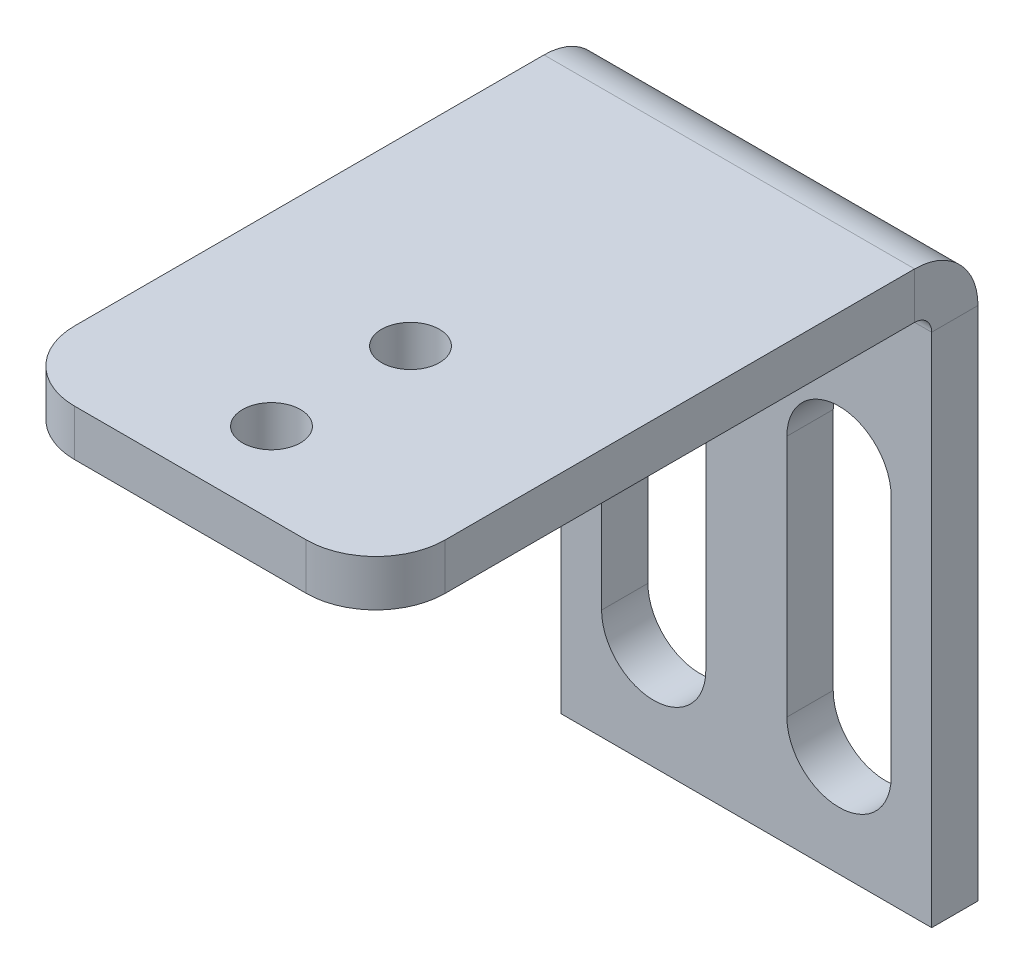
ISO-10303-21;
HEADER;
FILE_DESCRIPTION(('STEP AP214'),'2;1');
FILE_NAME('part.step','',(''),(''),'','','');
FILE_SCHEMA(('AUTOMOTIVE_DESIGN { 1 0 10303 214 1 1 1 1 }'));
ENDSEC;
DATA;
#1=APPLICATION_CONTEXT('core data for automotive mechanical design processes');
#2=APPLICATION_PROTOCOL_DEFINITION('international standard','automotive_design',2000,#1);
#3=PRODUCT_CONTEXT('',#1,'mechanical');
#4=PRODUCT('Part','Part','',(#3));
#5=PRODUCT_RELATED_PRODUCT_CATEGORY('part','',(#4));
#6=PRODUCT_DEFINITION_FORMATION('','',#4);
#7=PRODUCT_DEFINITION_CONTEXT('part definition',#1,'design');
#8=PRODUCT_DEFINITION('design','',#6,#7);
#9=PRODUCT_DEFINITION_SHAPE('','',#8);
#10=(LENGTH_UNIT() NAMED_UNIT(*) SI_UNIT(.MILLI.,.METRE.));
#11=(NAMED_UNIT(*) PLANE_ANGLE_UNIT() SI_UNIT($,.RADIAN.));
#12=(NAMED_UNIT(*) SI_UNIT($,.STERADIAN.) SOLID_ANGLE_UNIT());
#13=UNCERTAINTY_MEASURE_WITH_UNIT(LENGTH_MEASURE(1.E-05),#10,'distance_accuracy_value','');
#14=(GEOMETRIC_REPRESENTATION_CONTEXT(3) GLOBAL_UNCERTAINTY_ASSIGNED_CONTEXT((#13)) GLOBAL_UNIT_ASSIGNED_CONTEXT((#10,
#11,#12)) REPRESENTATION_CONTEXT('',''));
#15=CARTESIAN_POINT('',(0.,0.,0.));
#16=DIRECTION('',(0.,0.,1.));
#17=DIRECTION('',(1.,0.,0.));
#18=AXIS2_PLACEMENT_3D('',#15,#16,#17);
#19=CARTESIAN_POINT('',(0.,0.,-2.));
#20=DIRECTION('',(0.,0.,1.));
#21=DIRECTION('',(1.,0.,0.));
#22=AXIS2_PLACEMENT_3D('',#19,#20,#21);
#23=PLANE('',#22);
#24=DIRECTION('',(0.,-1.,0.));
#25=VECTOR('',#24,1.);
#26=CARTESIAN_POINT('',(0.051480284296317,0.25,-2.));
#27=LINE('',#26,#25);
#28=CARTESIAN_POINT('',(0.051480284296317,0.25,-2.));
#29=VERTEX_POINT('',#28);
#30=CARTESIAN_POINT('',(0.051480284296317,-10.25,-2.));
#31=VERTEX_POINT('',#30);
#32=EDGE_CURVE('E187',#29,#31,#27,.T.);
#33=ORIENTED_EDGE('',*,*,#32,.F.);
#34=CARTESIAN_POINT('',(-2.19851971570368,0.25,-2.));
#35=DIRECTION('',(0.,0.,1.));
#36=DIRECTION('',(1.,0.,0.));
#37=AXIS2_PLACEMENT_3D('',#34,#35,#36);
#38=CIRCLE('',#37,2.25);
#39=CARTESIAN_POINT('',(-4.44851971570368,0.25,-2.));
#40=VERTEX_POINT('',#39);
#41=EDGE_CURVE('E198',#29,#40,#38,.T.);
#42=ORIENTED_EDGE('',*,*,#41,.T.);
#43=DIRECTION('',(0.,-1.,0.));
#44=VECTOR('',#43,1.);
#45=CARTESIAN_POINT('',(-4.44851971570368,0.25,-2.));
#46=LINE('',#45,#44);
#47=CARTESIAN_POINT('',(-4.44851971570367,-10.25,-2.));
#48=VERTEX_POINT('',#47);
#49=EDGE_CURVE('E184',#40,#48,#46,.T.);
#50=ORIENTED_EDGE('',*,*,#49,.T.);
#51=CARTESIAN_POINT('',(-2.19851971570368,-10.25,-2.));
#52=DIRECTION('',(0.,0.,1.));
#53=DIRECTION('',(1.,0.,0.));
#54=AXIS2_PLACEMENT_3D('',#51,#52,#53);
#55=CIRCLE('',#54,2.25);
#56=EDGE_CURVE('E208',#48,#31,#55,.T.);
#57=ORIENTED_EDGE('',*,*,#56,.T.);
#58=EDGE_LOOP('',(#33,#42,#50,#57));
#59=FACE_BOUND('',#58,.T.);
#60=DIRECTION('',(-1.,0.,0.));
#61=VECTOR('',#60,1.);
#62=CARTESIAN_POINT('',(-6.19851971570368,7.2634,-2.));
#63=LINE('',#62,#61);
#64=CARTESIAN_POINT('',(-6.19851971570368,7.2634,-2.));
#65=VERTEX_POINT('',#64);
#66=CARTESIAN_POINT('',(9.80148028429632,7.2634,-2.));
#67=VERTEX_POINT('',#66);
#68=EDGE_CURVE('E238',#65,#67,#63,.F.);
#69=ORIENTED_EDGE('',*,*,#68,.T.);
#70=DIRECTION('',(0.,1.,0.));
#71=VECTOR('',#70,1.);
#72=CARTESIAN_POINT('',(9.80148028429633,-15.,-2.));
#73=LINE('',#72,#71);
#74=CARTESIAN_POINT('',(9.80148028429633,-15.,-2.));
#75=VERTEX_POINT('',#74);
#76=EDGE_CURVE('E261',#75,#67,#73,.T.);
#77=ORIENTED_EDGE('',*,*,#76,.F.);
#78=DIRECTION('',(1.,0.,0.));
#79=VECTOR('',#78,1.);
#80=CARTESIAN_POINT('',(9.80148028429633,-15.,-2.));
#81=LINE('',#80,#79);
#82=CARTESIAN_POINT('',(-6.19851971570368,-15.,-2.));
#83=VERTEX_POINT('',#82);
#84=EDGE_CURVE('E267',#83,#75,#81,.T.);
#85=ORIENTED_EDGE('',*,*,#84,.F.);
#86=DIRECTION('',(0.,-1.,0.));
#87=VECTOR('',#86,1.);
#88=CARTESIAN_POINT('',(-6.19851971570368,-15.,-2.));
#89=LINE('',#88,#87);
#90=EDGE_CURVE('E264',#65,#83,#89,.T.);
#91=ORIENTED_EDGE('',*,*,#90,.F.);
#92=EDGE_LOOP('',(#69,#77,#85,#91));
#93=FACE_BOUND('',#92,.T.);
#94=DIRECTION('',(0.,-1.,0.));
#95=VECTOR('',#94,1.);
#96=CARTESIAN_POINT('',(8.05148028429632,0.25,-2.));
#97=LINE('',#96,#95);
#98=CARTESIAN_POINT('',(8.05148028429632,0.25,-2.));
#99=VERTEX_POINT('',#98);
#100=CARTESIAN_POINT('',(8.05148028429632,-10.25,-2.));
#101=VERTEX_POINT('',#100);
#102=EDGE_CURVE('E154',#99,#101,#97,.T.);
#103=ORIENTED_EDGE('',*,*,#102,.F.);
#104=CARTESIAN_POINT('',(5.80148028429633,0.25,-2.));
#105=DIRECTION('',(0.,0.,1.));
#106=DIRECTION('',(1.,0.,0.));
#107=AXIS2_PLACEMENT_3D('',#104,#105,#106);
#108=CIRCLE('',#107,2.25);
#109=CARTESIAN_POINT('',(3.55148028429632,0.25,-2.));
#110=VERTEX_POINT('',#109);
#111=EDGE_CURVE('E162',#99,#110,#108,.T.);
#112=ORIENTED_EDGE('',*,*,#111,.T.);
#113=DIRECTION('',(0.,-1.,0.));
#114=VECTOR('',#113,1.);
#115=CARTESIAN_POINT('',(3.55148028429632,0.25,-2.));
#116=LINE('',#115,#114);
#117=CARTESIAN_POINT('',(3.55148028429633,-10.25,-2.));
#118=VERTEX_POINT('',#117);
#119=EDGE_CURVE('E637',#110,#118,#116,.T.);
#120=ORIENTED_EDGE('',*,*,#119,.T.);
#121=CARTESIAN_POINT('',(5.80148028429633,-10.25,-2.));
#122=DIRECTION('',(0.,0.,1.));
#123=DIRECTION('',(1.,0.,0.));
#124=AXIS2_PLACEMENT_3D('',#121,#122,#123);
#125=CIRCLE('',#124,2.25);
#126=EDGE_CURVE('E176',#118,#101,#125,.T.);
#127=ORIENTED_EDGE('',*,*,#126,.T.);
#128=EDGE_LOOP('',(#103,#112,#120,#127));
#129=FACE_BOUND('',#128,.T.);
#130=ADVANCED_FACE('F16',(#59,#93,#129),#23,.F.);
#131=CARTESIAN_POINT('',(0.,0.,0.));
#132=DIRECTION('',(0.,0.,1.));
#133=DIRECTION('',(1.,0.,0.));
#134=AXIS2_PLACEMENT_3D('',#131,#132,#133);
#135=PLANE('',#134);
#136=CARTESIAN_POINT('',(5.80148028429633,-10.25,0.));
#137=DIRECTION('',(0.,0.,1.));
#138=DIRECTION('',(1.,0.,0.));
#139=AXIS2_PLACEMENT_3D('',#136,#137,#138);
#140=CIRCLE('',#139,2.25);
#141=CARTESIAN_POINT('',(3.55148028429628,-10.25,0.));
#142=VERTEX_POINT('',#141);
#143=CARTESIAN_POINT('',(8.05148028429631,-10.25,0.));
#144=VERTEX_POINT('',#143);
#145=EDGE_CURVE('E174',#142,#144,#140,.T.);
#146=ORIENTED_EDGE('',*,*,#145,.F.);
#147=DIRECTION('',(0.,-1.,0.));
#148=VECTOR('',#147,1.);
#149=CARTESIAN_POINT('',(3.55148028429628,0.25,0.));
#150=LINE('',#149,#148);
#151=CARTESIAN_POINT('',(3.55148028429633,0.25,0.));
#152=VERTEX_POINT('',#151);
#153=EDGE_CURVE('E167',#152,#142,#150,.T.);
#154=ORIENTED_EDGE('',*,*,#153,.F.);
#155=CARTESIAN_POINT('',(5.80148028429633,0.25,0.));
#156=DIRECTION('',(0.,0.,1.));
#157=DIRECTION('',(1.,0.,0.));
#158=AXIS2_PLACEMENT_3D('',#155,#156,#157);
#159=CIRCLE('',#158,2.25);
#160=CARTESIAN_POINT('',(8.05148028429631,0.25,0.));
#161=VERTEX_POINT('',#160);
#162=EDGE_CURVE('E159',#161,#152,#159,.T.);
#163=ORIENTED_EDGE('',*,*,#162,.F.);
#164=DIRECTION('',(0.,-1.,0.));
#165=VECTOR('',#164,1.);
#166=CARTESIAN_POINT('',(8.05148028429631,0.25,0.));
#167=LINE('',#166,#165);
#168=EDGE_CURVE('E144',#161,#144,#167,.T.);
#169=ORIENTED_EDGE('',*,*,#168,.T.);
#170=EDGE_LOOP('',(#146,#154,#163,#169));
#171=FACE_BOUND('',#170,.T.);
#172=DIRECTION('',(0.,1.,0.));
#173=VECTOR('',#172,1.);
#174=CARTESIAN_POINT('',(9.80148028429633,-15.,0.));
#175=LINE('',#174,#173);
#176=CARTESIAN_POINT('',(9.80148028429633,-15.,0.));
#177=VERTEX_POINT('',#176);
#178=CARTESIAN_POINT('',(9.80148028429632,7.2634,0.));
#179=VERTEX_POINT('',#178);
#180=EDGE_CURVE('E258',#177,#179,#175,.T.);
#181=ORIENTED_EDGE('',*,*,#180,.T.);
#182=DIRECTION('',(-1.,0.,0.));
#183=VECTOR('',#182,1.);
#184=CARTESIAN_POINT('',(-6.19851971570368,7.2634,0.));
#185=LINE('',#184,#183);
#186=CARTESIAN_POINT('',(-6.19851971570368,7.2634,0.));
#187=VERTEX_POINT('',#186);
#188=EDGE_CURVE('E250',#187,#179,#185,.F.);
#189=ORIENTED_EDGE('',*,*,#188,.F.);
#190=DIRECTION('',(0.,-1.,0.));
#191=VECTOR('',#190,1.);
#192=CARTESIAN_POINT('',(-6.19851971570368,-15.,0.));
#193=LINE('',#192,#191);
#194=CARTESIAN_POINT('',(-6.19851971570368,-15.,0.));
#195=VERTEX_POINT('',#194);
#196=EDGE_CURVE('E273',#187,#195,#193,.T.);
#197=ORIENTED_EDGE('',*,*,#196,.T.);
#198=DIRECTION('',(1.,0.,0.));
#199=VECTOR('',#198,1.);
#200=CARTESIAN_POINT('',(9.80148028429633,-15.,0.));
#201=LINE('',#200,#199);
#202=EDGE_CURVE('E265',#195,#177,#201,.T.);
#203=ORIENTED_EDGE('',*,*,#202,.T.);
#204=EDGE_LOOP('',(#181,#189,#197,#203));
#205=FACE_BOUND('',#204,.T.);
#206=CARTESIAN_POINT('',(-2.19851971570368,0.25,0.));
#207=DIRECTION('',(0.,0.,1.));
#208=DIRECTION('',(1.,0.,0.));
#209=AXIS2_PLACEMENT_3D('',#206,#207,#208);
#210=CIRCLE('',#209,2.25);
#211=CARTESIAN_POINT('',(0.0514802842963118,0.25,0.));
#212=VERTEX_POINT('',#211);
#213=CARTESIAN_POINT('',(-4.44851971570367,0.25,0.));
#214=VERTEX_POINT('',#213);
#215=EDGE_CURVE('E196',#212,#214,#210,.T.);
#216=ORIENTED_EDGE('',*,*,#215,.F.);
#217=DIRECTION('',(0.,-1.,0.));
#218=VECTOR('',#217,1.);
#219=CARTESIAN_POINT('',(0.0514802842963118,0.25,0.));
#220=LINE('',#219,#218);
#221=CARTESIAN_POINT('',(0.0514802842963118,-10.25,0.));
#222=VERTEX_POINT('',#221);
#223=EDGE_CURVE('E190',#212,#222,#220,.T.);
#224=ORIENTED_EDGE('',*,*,#223,.T.);
#225=CARTESIAN_POINT('',(-2.19851971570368,-10.25,0.));
#226=DIRECTION('',(0.,0.,1.));
#227=DIRECTION('',(1.,0.,0.));
#228=AXIS2_PLACEMENT_3D('',#225,#226,#227);
#229=CIRCLE('',#228,2.25);
#230=CARTESIAN_POINT('',(-4.44851971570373,-10.25,0.));
#231=VERTEX_POINT('',#230);
#232=EDGE_CURVE('E206',#231,#222,#229,.T.);
#233=ORIENTED_EDGE('',*,*,#232,.F.);
#234=DIRECTION('',(0.,-1.,0.));
#235=VECTOR('',#234,1.);
#236=CARTESIAN_POINT('',(-4.44851971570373,0.25,0.));
#237=LINE('',#236,#235);
#238=EDGE_CURVE('E182',#214,#231,#237,.T.);
#239=ORIENTED_EDGE('',*,*,#238,.F.);
#240=EDGE_LOOP('',(#216,#224,#233,#239));
#241=FACE_BOUND('',#240,.T.);
#242=ADVANCED_FACE('F165',(#171,#205,#241),#135,.T.);
#243=CARTESIAN_POINT('',(-6.19851971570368,-15.,-2.));
#244=DIRECTION('',(-1.,0.,0.));
#245=DIRECTION('',(0.,0.,1.));
#246=AXIS2_PLACEMENT_3D('',#243,#244,#245);
#247=PLANE('',#246);
#248=ORIENTED_EDGE('',*,*,#196,.F.);
#249=DIRECTION('',(0.,0.,-1.));
#250=VECTOR('',#249,1.);
#251=CARTESIAN_POINT('',(-6.19851971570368,7.2634,0.));
#252=LINE('',#251,#250);
#253=EDGE_CURVE('E244',#187,#65,#252,.T.);
#254=ORIENTED_EDGE('',*,*,#253,.T.);
#255=ORIENTED_EDGE('',*,*,#90,.T.);
#256=DIRECTION('',(0.,0.,1.));
#257=VECTOR('',#256,1.);
#258=CARTESIAN_POINT('',(-6.19851971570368,-15.,-2.));
#259=LINE('',#258,#257);
#260=EDGE_CURVE('E270',#83,#195,#259,.T.);
#261=ORIENTED_EDGE('',*,*,#260,.T.);
#262=EDGE_LOOP('',(#248,#254,#255,#261));
#263=FACE_BOUND('',#262,.T.);
#264=ADVANCED_FACE('F354',(#263),#247,.T.);
#265=CARTESIAN_POINT('',(9.80148028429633,-15.,-2.));
#266=DIRECTION('',(1.,0.,0.));
#267=DIRECTION('',(0.,1.,0.));
#268=AXIS2_PLACEMENT_3D('',#265,#266,#267);
#269=PLANE('',#268);
#270=DIRECTION('',(0.,0.,-1.));
#271=VECTOR('',#270,1.);
#272=CARTESIAN_POINT('',(9.80148028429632,7.2634,0.));
#273=LINE('',#272,#271);
#274=EDGE_CURVE('E255',#179,#67,#273,.T.);
#275=ORIENTED_EDGE('',*,*,#274,.F.);
#276=ORIENTED_EDGE('',*,*,#180,.F.);
#277=DIRECTION('',(0.,0.,1.));
#278=VECTOR('',#277,1.);
#279=CARTESIAN_POINT('',(9.80148028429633,-15.,-2.));
#280=LINE('',#279,#278);
#281=EDGE_CURVE('E277',#75,#177,#280,.T.);
#282=ORIENTED_EDGE('',*,*,#281,.F.);
#283=ORIENTED_EDGE('',*,*,#76,.T.);
#284=EDGE_LOOP('',(#275,#276,#282,#283));
#285=FACE_BOUND('',#284,.T.);
#286=ADVANCED_FACE('F329',(#285),#269,.T.);
#287=CARTESIAN_POINT('',(9.80148028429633,-15.,-2.));
#288=DIRECTION('',(0.,-1.,0.));
#289=DIRECTION('',(0.,0.,-1.));
#290=AXIS2_PLACEMENT_3D('',#287,#288,#289);
#291=PLANE('',#290);
#292=ORIENTED_EDGE('',*,*,#202,.F.);
#293=ORIENTED_EDGE('',*,*,#260,.F.);
#294=ORIENTED_EDGE('',*,*,#84,.T.);
#295=ORIENTED_EDGE('',*,*,#281,.T.);
#296=EDGE_LOOP('',(#292,#293,#294,#295));
#297=FACE_BOUND('',#296,.T.);
#298=ADVANCED_FACE('F360',(#297),#291,.T.);
#299=CARTESIAN_POINT('',(9.80148028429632,7.2634,0.7366));
#300=DIRECTION('',(1.,0.,0.));
#301=DIRECTION('',(0.,0.,-1.));
#302=AXIS2_PLACEMENT_3D('',#299,#300,#301);
#303=PLANE('',#302);
#304=DIRECTION('',(0.,-1.,0.));
#305=VECTOR('',#304,1.);
#306=CARTESIAN_POINT('',(9.80148028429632,10.,0.73659999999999));
#307=LINE('',#306,#305);
#308=CARTESIAN_POINT('',(9.80148028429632,8.,0.7366));
#309=VERTEX_POINT('',#308);
#310=CARTESIAN_POINT('',(9.80148028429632,10.,0.73659999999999));
#311=VERTEX_POINT('',#310);
#312=EDGE_CURVE('E214',#309,#311,#307,.F.);
#313=ORIENTED_EDGE('',*,*,#312,.F.);
#314=CARTESIAN_POINT('',(9.80148028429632,7.2634,0.7366));
#315=DIRECTION('',(-1.,0.,0.));
#316=DIRECTION('',(0.,0.,1.));
#317=AXIS2_PLACEMENT_3D('',#314,#315,#316);
#318=CIRCLE('',#317,0.7366);
#319=EDGE_CURVE('E247',#179,#309,#318,.F.);
#320=ORIENTED_EDGE('',*,*,#319,.F.);
#321=ORIENTED_EDGE('',*,*,#274,.T.);
#322=CARTESIAN_POINT('',(9.80148028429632,7.2634,0.7366));
#323=DIRECTION('',(-1.,0.,0.));
#324=DIRECTION('',(0.,0.,1.));
#325=AXIS2_PLACEMENT_3D('',#322,#323,#324);
#326=CIRCLE('',#325,2.7366);
#327=EDGE_CURVE('E240',#67,#311,#326,.F.);
#328=ORIENTED_EDGE('',*,*,#327,.T.);
#329=EDGE_LOOP('',(#313,#320,#321,#328));
#330=FACE_BOUND('',#329,.T.);
#331=ADVANCED_FACE('F325',(#330),#303,.T.);
#332=CARTESIAN_POINT('',(-6.19851971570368,7.2634,0.7366));
#333=DIRECTION('',(1.,0.,0.));
#334=DIRECTION('',(0.,0.,-1.));
#335=AXIS2_PLACEMENT_3D('',#332,#333,#334);
#336=PLANE('',#335);
#337=CARTESIAN_POINT('',(-6.19851971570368,7.2634,0.7366));
#338=DIRECTION('',(-1.,0.,0.));
#339=DIRECTION('',(0.,0.,1.));
#340=AXIS2_PLACEMENT_3D('',#337,#338,#339);
#341=CIRCLE('',#340,0.7366);
#342=CARTESIAN_POINT('',(-6.19851971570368,8.,0.7366));
#343=VERTEX_POINT('',#342);
#344=EDGE_CURVE('E217',#343,#187,#341,.T.);
#345=ORIENTED_EDGE('',*,*,#344,.F.);
#346=DIRECTION('',(0.,-1.,0.));
#347=VECTOR('',#346,1.);
#348=CARTESIAN_POINT('',(-6.19851971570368,8.,0.7366));
#349=LINE('',#348,#347);
#350=CARTESIAN_POINT('',(-6.19851971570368,10.,0.736599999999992));
#351=VERTEX_POINT('',#350);
#352=EDGE_CURVE('E231',#343,#351,#349,.F.);
#353=ORIENTED_EDGE('',*,*,#352,.T.);
#354=CARTESIAN_POINT('',(-6.19851971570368,7.2634,0.7366));
#355=DIRECTION('',(-1.,0.,0.));
#356=DIRECTION('',(0.,0.,1.));
#357=AXIS2_PLACEMENT_3D('',#354,#355,#356);
#358=CIRCLE('',#357,2.7366);
#359=EDGE_CURVE('E241',#351,#65,#358,.T.);
#360=ORIENTED_EDGE('',*,*,#359,.T.);
#361=ORIENTED_EDGE('',*,*,#253,.F.);
#362=EDGE_LOOP('',(#345,#353,#360,#361));
#363=FACE_BOUND('',#362,.T.);
#364=ADVANCED_FACE('F318',(#363),#336,.F.);
#365=CARTESIAN_POINT('',(-6.19851971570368,7.2634,0.7366));
#366=DIRECTION('',(-1.,0.,0.));
#367=DIRECTION('',(0.,1.,0.));
#368=AXIS2_PLACEMENT_3D('',#365,#366,#367);
#369=CYLINDRICAL_SURFACE('',#368,2.7366);
#370=ORIENTED_EDGE('',*,*,#68,.F.);
#371=ORIENTED_EDGE('',*,*,#359,.F.);
#372=DIRECTION('',(-1.,0.,0.));
#373=VECTOR('',#372,1.);
#374=CARTESIAN_POINT('',(9.80148028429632,10.,0.73659999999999));
#375=LINE('',#374,#373);
#376=EDGE_CURVE('E228',#351,#311,#375,.F.);
#377=ORIENTED_EDGE('',*,*,#376,.T.);
#378=ORIENTED_EDGE('',*,*,#327,.F.);
#379=EDGE_LOOP('',(#370,#371,#377,#378));
#380=FACE_BOUND('',#379,.T.);
#381=ADVANCED_FACE('F323',(#380),#369,.T.);
#382=CARTESIAN_POINT('',(-6.19851971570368,7.2634,0.7366));
#383=DIRECTION('',(-1.,0.,0.));
#384=DIRECTION('',(0.,1.,0.));
#385=AXIS2_PLACEMENT_3D('',#382,#383,#384);
#386=CYLINDRICAL_SURFACE('',#385,0.7366);
#387=ORIENTED_EDGE('',*,*,#188,.T.);
#388=ORIENTED_EDGE('',*,*,#319,.T.);
#389=DIRECTION('',(-1.,0.,0.));
#390=VECTOR('',#389,1.);
#391=CARTESIAN_POINT('',(9.80148028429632,8.,0.7366));
#392=LINE('',#391,#390);
#393=EDGE_CURVE('E234',#309,#343,#392,.T.);
#394=ORIENTED_EDGE('',*,*,#393,.T.);
#395=ORIENTED_EDGE('',*,*,#344,.T.);
#396=EDGE_LOOP('',(#387,#388,#394,#395));
#397=FACE_BOUND('',#396,.T.);
#398=ADVANCED_FACE('F335',(#397),#386,.F.);
#399=CARTESIAN_POINT('',(9.80148028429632,10.,0.));
#400=DIRECTION('',(-1.,0.,0.));
#401=DIRECTION('',(0.,-1.,0.));
#402=AXIS2_PLACEMENT_3D('',#399,#400,#401);
#403=PLANE('',#402);
#404=DIRECTION('',(0.,0.,-1.));
#405=VECTOR('',#404,1.);
#406=CARTESIAN_POINT('',(9.80148028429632,10.,0.));
#407=LINE('',#406,#405);
#408=CARTESIAN_POINT('',(9.80148028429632,10.,21.));
#409=VERTEX_POINT('',#408);
#410=EDGE_CURVE('E220',#409,#311,#407,.T.);
#411=ORIENTED_EDGE('',*,*,#410,.F.);
#412=DIRECTION('',(0.,-1.,0.));
#413=VECTOR('',#412,1.);
#414=CARTESIAN_POINT('',(9.80148028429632,10.,21.));
#415=LINE('',#414,#413);
#416=CARTESIAN_POINT('',(9.80148028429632,8.,21.));
#417=VERTEX_POINT('',#416);
#418=EDGE_CURVE('E279',#409,#417,#415,.T.);
#419=ORIENTED_EDGE('',*,*,#418,.T.);
#420=DIRECTION('',(0.,0.,1.));
#421=VECTOR('',#420,1.);
#422=CARTESIAN_POINT('',(9.80148028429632,8.,0.));
#423=LINE('',#422,#421);
#424=EDGE_CURVE('E226',#417,#309,#423,.F.);
#425=ORIENTED_EDGE('',*,*,#424,.T.);
#426=ORIENTED_EDGE('',*,*,#312,.T.);
#427=EDGE_LOOP('',(#411,#419,#425,#426));
#428=FACE_BOUND('',#427,.T.);
#429=ADVANCED_FACE('F301',(#428),#403,.F.);
#430=CARTESIAN_POINT('',(-6.19851971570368,10.,24.));
#431=DIRECTION('',(1.,0.,0.));
#432=DIRECTION('',(0.,1.,0.));
#433=AXIS2_PLACEMENT_3D('',#430,#431,#432);
#434=PLANE('',#433);
#435=DIRECTION('',(0.,0.,-1.));
#436=VECTOR('',#435,1.);
#437=CARTESIAN_POINT('',(-6.19851971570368,8.,24.));
#438=LINE('',#437,#436);
#439=CARTESIAN_POINT('',(-6.19851971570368,8.,21.));
#440=VERTEX_POINT('',#439);
#441=EDGE_CURVE('E224',#343,#440,#438,.F.);
#442=ORIENTED_EDGE('',*,*,#441,.T.);
#443=DIRECTION('',(0.,-1.,0.));
#444=VECTOR('',#443,1.);
#445=CARTESIAN_POINT('',(-6.19851971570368,10.,21.));
#446=LINE('',#445,#444);
#447=CARTESIAN_POINT('',(-6.19851971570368,10.,21.));
#448=VERTEX_POINT('',#447);
#449=EDGE_CURVE('E11',#440,#448,#446,.F.);
#450=ORIENTED_EDGE('',*,*,#449,.T.);
#451=DIRECTION('',(0.,0.,1.));
#452=VECTOR('',#451,1.);
#453=CARTESIAN_POINT('',(-6.19851971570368,10.,0.));
#454=LINE('',#453,#452);
#455=EDGE_CURVE('E218',#351,#448,#454,.T.);
#456=ORIENTED_EDGE('',*,*,#455,.F.);
#457=ORIENTED_EDGE('',*,*,#352,.F.);
#458=EDGE_LOOP('',(#442,#450,#456,#457));
#459=FACE_BOUND('',#458,.T.);
#460=ADVANCED_FACE('F315',(#459),#434,.F.);
#461=CARTESIAN_POINT('',(0.,10.,0.));
#462=DIRECTION('',(0.,-1.,0.));
#463=DIRECTION('',(0.,0.,-1.));
#464=AXIS2_PLACEMENT_3D('',#461,#462,#463);
#465=PLANE('',#464);
#466=CARTESIAN_POINT('',(1.80148028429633,10.0000000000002,20.5));
#467=DIRECTION('',(0.,-1.,0.));
#468=DIRECTION('',(0.,0.,-1.));
#469=AXIS2_PLACEMENT_3D('',#466,#467,#468);
#470=CIRCLE('',#469,1.25);
#471=CARTESIAN_POINT('',(1.80148028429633,10.0000000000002,19.25));
#472=VERTEX_POINT('',#471);
#473=EDGE_CURVE('E628',#472,#472,#470,.T.);
#474=ORIENTED_EDGE('',*,*,#473,.T.);
#475=EDGE_LOOP('',(#474));
#476=FACE_BOUND('',#475,.T.);
#477=CARTESIAN_POINT('',(1.80148028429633,10.0000000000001,14.5));
#478=DIRECTION('',(0.,-1.,0.));
#479=DIRECTION('',(0.,0.,-1.));
#480=AXIS2_PLACEMENT_3D('',#477,#478,#479);
#481=CIRCLE('',#480,1.25);
#482=CARTESIAN_POINT('',(1.80148028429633,10.0000000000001,13.25));
#483=VERTEX_POINT('',#482);
#484=EDGE_CURVE('E627',#483,#483,#481,.T.);
#485=ORIENTED_EDGE('',*,*,#484,.T.);
#486=EDGE_LOOP('',(#485));
#487=FACE_BOUND('',#486,.T.);
#488=DIRECTION('',(1.,0.,0.));
#489=VECTOR('',#488,1.);
#490=CARTESIAN_POINT('',(0.,10.,24.));
#491=LINE('',#490,#489);
#492=CARTESIAN_POINT('',(-3.19851971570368,10.,24.));
#493=VERTEX_POINT('',#492);
#494=CARTESIAN_POINT('',(6.80148028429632,10.,24.));
#495=VERTEX_POINT('',#494);
#496=EDGE_CURVE('E215',#493,#495,#491,.T.);
#497=ORIENTED_EDGE('',*,*,#496,.T.);
#498=CARTESIAN_POINT('',(6.80148028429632,10.,21.));
#499=DIRECTION('',(0.,-1.,0.));
#500=DIRECTION('',(0.,0.,-1.));
#501=AXIS2_PLACEMENT_3D('',#498,#499,#500);
#502=CIRCLE('',#501,3.);
#503=EDGE_CURVE('E24',#495,#409,#502,.F.);
#504=ORIENTED_EDGE('',*,*,#503,.T.);
#505=ORIENTED_EDGE('',*,*,#410,.T.);
#506=ORIENTED_EDGE('',*,*,#376,.F.);
#507=ORIENTED_EDGE('',*,*,#455,.T.);
#508=CARTESIAN_POINT('',(-3.19851971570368,10.,21.));
#509=DIRECTION('',(0.,-1.,0.));
#510=DIRECTION('',(0.,0.,-1.));
#511=AXIS2_PLACEMENT_3D('',#508,#509,#510);
#512=CIRCLE('',#511,3.);
#513=EDGE_CURVE('E292',#448,#493,#512,.F.);
#514=ORIENTED_EDGE('',*,*,#513,.T.);
#515=EDGE_LOOP('',(#497,#504,#505,#506,#507,#514));
#516=FACE_BOUND('',#515,.T.);
#517=ADVANCED_FACE('F296',(#476,#487,#516),#465,.F.);
#518=CARTESIAN_POINT('',(0.,8.,0.));
#519=DIRECTION('',(0.,-1.,0.));
#520=DIRECTION('',(0.,0.,-1.));
#521=AXIS2_PLACEMENT_3D('',#518,#519,#520);
#522=PLANE('',#521);
#523=CARTESIAN_POINT('',(1.80148028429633,8.,20.5));
#524=DIRECTION('',(0.,-1.,0.));
#525=DIRECTION('',(0.,0.,-1.));
#526=AXIS2_PLACEMENT_3D('',#523,#524,#525);
#527=CIRCLE('',#526,1.25);
#528=CARTESIAN_POINT('',(1.80148028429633,8.,19.25));
#529=VERTEX_POINT('',#528);
#530=EDGE_CURVE('E622',#529,#529,#527,.T.);
#531=ORIENTED_EDGE('',*,*,#530,.F.);
#532=EDGE_LOOP('',(#531));
#533=FACE_BOUND('',#532,.T.);
#534=CARTESIAN_POINT('',(1.80148028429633,8.,14.5));
#535=DIRECTION('',(0.,-1.,0.));
#536=DIRECTION('',(0.,0.,-1.));
#537=AXIS2_PLACEMENT_3D('',#534,#535,#536);
#538=CIRCLE('',#537,1.25);
#539=CARTESIAN_POINT('',(1.80148028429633,8.,13.25));
#540=VERTEX_POINT('',#539);
#541=EDGE_CURVE('E625',#540,#540,#538,.T.);
#542=ORIENTED_EDGE('',*,*,#541,.F.);
#543=EDGE_LOOP('',(#542));
#544=FACE_BOUND('',#543,.T.);
#545=ORIENTED_EDGE('',*,*,#424,.F.);
#546=CARTESIAN_POINT('',(6.80148028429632,8.,21.));
#547=DIRECTION('',(0.,-1.,0.));
#548=DIRECTION('',(0.,0.,-1.));
#549=AXIS2_PLACEMENT_3D('',#546,#547,#548);
#550=CIRCLE('',#549,3.);
#551=CARTESIAN_POINT('',(6.80148028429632,8.,24.));
#552=VERTEX_POINT('',#551);
#553=EDGE_CURVE('E286',#417,#552,#550,.T.);
#554=ORIENTED_EDGE('',*,*,#553,.T.);
#555=DIRECTION('',(-1.,0.,0.));
#556=VECTOR('',#555,1.);
#557=CARTESIAN_POINT('',(9.80148028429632,8.,24.));
#558=LINE('',#557,#556);
#559=CARTESIAN_POINT('',(-3.19851971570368,8.,24.));
#560=VERTEX_POINT('',#559);
#561=EDGE_CURVE('E222',#560,#552,#558,.F.);
#562=ORIENTED_EDGE('',*,*,#561,.F.);
#563=CARTESIAN_POINT('',(-3.19851971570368,8.,21.));
#564=DIRECTION('',(0.,-1.,0.));
#565=DIRECTION('',(0.,0.,-1.));
#566=AXIS2_PLACEMENT_3D('',#563,#564,#565);
#567=CIRCLE('',#566,3.);
#568=EDGE_CURVE('E284',#560,#440,#567,.T.);
#569=ORIENTED_EDGE('',*,*,#568,.T.);
#570=ORIENTED_EDGE('',*,*,#441,.F.);
#571=ORIENTED_EDGE('',*,*,#393,.F.);
#572=EDGE_LOOP('',(#545,#554,#562,#569,#570,#571));
#573=FACE_BOUND('',#572,.T.);
#574=ADVANCED_FACE('F307',(#533,#544,#573),#522,.T.);
#575=CARTESIAN_POINT('',(9.80148028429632,10.,24.));
#576=DIRECTION('',(0.,0.,-1.));
#577=DIRECTION('',(0.,1.,0.));
#578=AXIS2_PLACEMENT_3D('',#575,#576,#577);
#579=PLANE('',#578);
#580=ORIENTED_EDGE('',*,*,#561,.T.);
#581=DIRECTION('',(0.,-1.,0.));
#582=VECTOR('',#581,1.);
#583=CARTESIAN_POINT('',(6.80148028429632,10.,24.));
#584=LINE('',#583,#582);
#585=EDGE_CURVE('E37',#552,#495,#584,.F.);
#586=ORIENTED_EDGE('',*,*,#585,.T.);
#587=ORIENTED_EDGE('',*,*,#496,.F.);
#588=DIRECTION('',(0.,-1.,0.));
#589=VECTOR('',#588,1.);
#590=CARTESIAN_POINT('',(-3.19851971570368,10.,24.));
#591=LINE('',#590,#589);
#592=EDGE_CURVE('E288',#493,#560,#591,.T.);
#593=ORIENTED_EDGE('',*,*,#592,.T.);
#594=EDGE_LOOP('',(#580,#586,#587,#593));
#595=FACE_BOUND('',#594,.T.);
#596=ADVANCED_FACE('F309',(#595),#579,.F.);
#597=CARTESIAN_POINT('',(-2.19851971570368,-10.25,0.));
#598=DIRECTION('',(0.,0.,1.));
#599=DIRECTION('',(1.,0.,0.));
#600=AXIS2_PLACEMENT_3D('',#597,#598,#599);
#601=CYLINDRICAL_SURFACE('',#600,2.25);
#602=ORIENTED_EDGE('',*,*,#232,.T.);
#603=DIRECTION('',(0.,0.,-1.));
#604=VECTOR('',#603,1.);
#605=CARTESIAN_POINT('',(0.0514802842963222,-10.25,-2.));
#606=LINE('',#605,#604);
#607=EDGE_CURVE('E204',#222,#31,#606,.T.);
#608=ORIENTED_EDGE('',*,*,#607,.T.);
#609=ORIENTED_EDGE('',*,*,#56,.F.);
#610=DIRECTION('',(0.,0.,1.));
#611=VECTOR('',#610,1.);
#612=CARTESIAN_POINT('',(-4.44851971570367,-10.25,0.));
#613=LINE('',#612,#611);
#614=EDGE_CURVE('E211',#231,#48,#613,.F.);
#615=ORIENTED_EDGE('',*,*,#614,.F.);
#616=EDGE_LOOP('',(#602,#608,#609,#615));
#617=FACE_BOUND('',#616,.T.);
#618=ADVANCED_FACE('F410',(#617),#601,.F.);
#619=CARTESIAN_POINT('',(-2.19851971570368,0.25,0.));
#620=DIRECTION('',(0.,0.,1.));
#621=DIRECTION('',(1.,0.,0.));
#622=AXIS2_PLACEMENT_3D('',#619,#620,#621);
#623=CYLINDRICAL_SURFACE('',#622,2.25);
#624=ORIENTED_EDGE('',*,*,#41,.F.);
#625=DIRECTION('',(0.,0.,-1.));
#626=VECTOR('',#625,1.);
#627=CARTESIAN_POINT('',(0.0514802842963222,0.25,-2.));
#628=LINE('',#627,#626);
#629=EDGE_CURVE('E193',#212,#29,#628,.T.);
#630=ORIENTED_EDGE('',*,*,#629,.F.);
#631=ORIENTED_EDGE('',*,*,#215,.T.);
#632=DIRECTION('',(0.,0.,1.));
#633=VECTOR('',#632,1.);
#634=CARTESIAN_POINT('',(-4.44851971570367,0.25,0.));
#635=LINE('',#634,#633);
#636=EDGE_CURVE('E201',#40,#214,#635,.T.);
#637=ORIENTED_EDGE('',*,*,#636,.F.);
#638=EDGE_LOOP('',(#624,#630,#631,#637));
#639=FACE_BOUND('',#638,.T.);
#640=ADVANCED_FACE('F406',(#639),#623,.F.);
#641=CARTESIAN_POINT('',(0.0514802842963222,0.25,-2.));
#642=DIRECTION('',(-1.,0.,0.));
#643=DIRECTION('',(0.,0.,1.));
#644=AXIS2_PLACEMENT_3D('',#641,#642,#643);
#645=PLANE('',#644);
#646=ORIENTED_EDGE('',*,*,#607,.F.);
#647=ORIENTED_EDGE('',*,*,#223,.F.);
#648=ORIENTED_EDGE('',*,*,#629,.T.);
#649=ORIENTED_EDGE('',*,*,#32,.T.);
#650=EDGE_LOOP('',(#646,#647,#648,#649));
#651=FACE_BOUND('',#650,.T.);
#652=ADVANCED_FACE('F402',(#651),#645,.T.);
#653=CARTESIAN_POINT('',(-4.44851971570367,0.25,0.));
#654=DIRECTION('',(-1.,0.,0.));
#655=DIRECTION('',(0.,0.,1.));
#656=AXIS2_PLACEMENT_3D('',#653,#654,#655);
#657=PLANE('',#656);
#658=ORIENTED_EDGE('',*,*,#614,.T.);
#659=ORIENTED_EDGE('',*,*,#49,.F.);
#660=ORIENTED_EDGE('',*,*,#636,.T.);
#661=ORIENTED_EDGE('',*,*,#238,.T.);
#662=EDGE_LOOP('',(#658,#659,#660,#661));
#663=FACE_BOUND('',#662,.T.);
#664=ADVANCED_FACE('F398',(#663),#657,.F.);
#665=CARTESIAN_POINT('',(5.80148028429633,-10.25,0.));
#666=DIRECTION('',(0.,0.,1.));
#667=DIRECTION('',(1.,0.,0.));
#668=AXIS2_PLACEMENT_3D('',#665,#666,#667);
#669=CYLINDRICAL_SURFACE('',#668,2.25);
#670=ORIENTED_EDGE('',*,*,#145,.T.);
#671=DIRECTION('',(0.,0.,-1.));
#672=VECTOR('',#671,1.);
#673=CARTESIAN_POINT('',(8.05148028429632,-10.25,-2.));
#674=LINE('',#673,#672);
#675=EDGE_CURVE('E150',#144,#101,#674,.T.);
#676=ORIENTED_EDGE('',*,*,#675,.T.);
#677=ORIENTED_EDGE('',*,*,#126,.F.);
#678=DIRECTION('',(0.,0.,1.));
#679=VECTOR('',#678,1.);
#680=CARTESIAN_POINT('',(3.55148028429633,-10.25,0.));
#681=LINE('',#680,#679);
#682=EDGE_CURVE('E179',#142,#118,#681,.F.);
#683=ORIENTED_EDGE('',*,*,#682,.F.);
#684=EDGE_LOOP('',(#670,#676,#677,#683));
#685=FACE_BOUND('',#684,.T.);
#686=ADVANCED_FACE('F395',(#685),#669,.F.);
#687=CARTESIAN_POINT('',(5.80148028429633,0.25,0.));
#688=DIRECTION('',(0.,0.,1.));
#689=DIRECTION('',(1.,0.,0.));
#690=AXIS2_PLACEMENT_3D('',#687,#688,#689);
#691=CYLINDRICAL_SURFACE('',#690,2.25);
#692=ORIENTED_EDGE('',*,*,#111,.F.);
#693=DIRECTION('',(0.,0.,-1.));
#694=VECTOR('',#693,1.);
#695=CARTESIAN_POINT('',(8.05148028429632,0.25,-2.));
#696=LINE('',#695,#694);
#697=EDGE_CURVE('E148',#161,#99,#696,.T.);
#698=ORIENTED_EDGE('',*,*,#697,.F.);
#699=ORIENTED_EDGE('',*,*,#162,.T.);
#700=DIRECTION('',(0.,0.,1.));
#701=VECTOR('',#700,1.);
#702=CARTESIAN_POINT('',(3.55148028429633,0.25,0.));
#703=LINE('',#702,#701);
#704=EDGE_CURVE('E169',#110,#152,#703,.T.);
#705=ORIENTED_EDGE('',*,*,#704,.F.);
#706=EDGE_LOOP('',(#692,#698,#699,#705));
#707=FACE_BOUND('',#706,.T.);
#708=ADVANCED_FACE('F157',(#707),#691,.F.);
#709=CARTESIAN_POINT('',(8.05148028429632,0.25,-2.));
#710=DIRECTION('',(-1.,0.,0.));
#711=DIRECTION('',(0.,0.,1.));
#712=AXIS2_PLACEMENT_3D('',#709,#710,#711);
#713=PLANE('',#712);
#714=ORIENTED_EDGE('',*,*,#675,.F.);
#715=ORIENTED_EDGE('',*,*,#168,.F.);
#716=ORIENTED_EDGE('',*,*,#697,.T.);
#717=ORIENTED_EDGE('',*,*,#102,.T.);
#718=EDGE_LOOP('',(#714,#715,#716,#717));
#719=FACE_BOUND('',#718,.T.);
#720=ADVANCED_FACE('F146',(#719),#713,.T.);
#721=CARTESIAN_POINT('',(3.55148028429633,0.25,0.));
#722=DIRECTION('',(-1.,0.,0.));
#723=DIRECTION('',(0.,0.,1.));
#724=AXIS2_PLACEMENT_3D('',#721,#722,#723);
#725=PLANE('',#724);
#726=ORIENTED_EDGE('',*,*,#682,.T.);
#727=ORIENTED_EDGE('',*,*,#119,.F.);
#728=ORIENTED_EDGE('',*,*,#704,.T.);
#729=ORIENTED_EDGE('',*,*,#153,.T.);
#730=EDGE_LOOP('',(#726,#727,#728,#729));
#731=FACE_BOUND('',#730,.T.);
#732=ADVANCED_FACE('F382',(#731),#725,.F.);
#733=CARTESIAN_POINT('',(1.80148028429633,8.,14.5));
#734=DIRECTION('',(0.,-1.,0.));
#735=DIRECTION('',(0.,0.,-1.));
#736=AXIS2_PLACEMENT_3D('',#733,#734,#735);
#737=CYLINDRICAL_SURFACE('',#736,1.25);
#738=ORIENTED_EDGE('',*,*,#484,.F.);
#739=EDGE_LOOP('',(#738));
#740=FACE_BOUND('',#739,.T.);
#741=ORIENTED_EDGE('',*,*,#541,.T.);
#742=EDGE_LOOP('',(#741));
#743=FACE_BOUND('',#742,.T.);
#744=ADVANCED_FACE('F376',(#740,#743),#737,.F.);
#745=CARTESIAN_POINT('',(1.80148028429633,8.,20.5));
#746=DIRECTION('',(0.,-1.,0.));
#747=DIRECTION('',(0.,0.,-1.));
#748=AXIS2_PLACEMENT_3D('',#745,#746,#747);
#749=CYLINDRICAL_SURFACE('',#748,1.25);
#750=ORIENTED_EDGE('',*,*,#473,.F.);
#751=EDGE_LOOP('',(#750));
#752=FACE_BOUND('',#751,.T.);
#753=ORIENTED_EDGE('',*,*,#530,.T.);
#754=EDGE_LOOP('',(#753));
#755=FACE_BOUND('',#754,.T.);
#756=ADVANCED_FACE('F369',(#752,#755),#749,.F.);
#757=CARTESIAN_POINT('',(6.80148028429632,10.,21.));
#758=DIRECTION('',(0.,-1.,0.));
#759=DIRECTION('',(0.,0.,-1.));
#760=AXIS2_PLACEMENT_3D('',#757,#758,#759);
#761=CYLINDRICAL_SURFACE('',#760,3.);
#762=ORIENTED_EDGE('',*,*,#503,.F.);
#763=ORIENTED_EDGE('',*,*,#585,.F.);
#764=ORIENTED_EDGE('',*,*,#553,.F.);
#765=ORIENTED_EDGE('',*,*,#418,.F.);
#766=EDGE_LOOP('',(#762,#763,#764,#765));
#767=FACE_BOUND('',#766,.T.);
#768=ADVANCED_FACE('F304',(#767),#761,.T.);
#769=CARTESIAN_POINT('',(-3.19851971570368,10.,21.));
#770=DIRECTION('',(0.,-1.,0.));
#771=DIRECTION('',(0.,0.,-1.));
#772=AXIS2_PLACEMENT_3D('',#769,#770,#771);
#773=CYLINDRICAL_SURFACE('',#772,3.);
#774=ORIENTED_EDGE('',*,*,#513,.F.);
#775=ORIENTED_EDGE('',*,*,#449,.F.);
#776=ORIENTED_EDGE('',*,*,#568,.F.);
#777=ORIENTED_EDGE('',*,*,#592,.F.);
#778=EDGE_LOOP('',(#774,#775,#776,#777));
#779=FACE_BOUND('',#778,.T.);
#780=ADVANCED_FACE('F18',(#779),#773,.T.);
#781=CLOSED_SHELL('',(#130,#242,#264,#286,#298,#331,#364,#381,#398,#429,#460,#517,#574,#596,
#618,#640,#652,#664,#686,#708,#720,#732,#744,#756,#768,#780));
#782=MANIFOLD_SOLID_BREP('B1',#781);
#783=ADVANCED_BREP_SHAPE_REPRESENTATION('',(#18,#782),#14);
#784=SHAPE_DEFINITION_REPRESENTATION(#9,#783);
ENDSEC;
END-ISO-10303-21;
